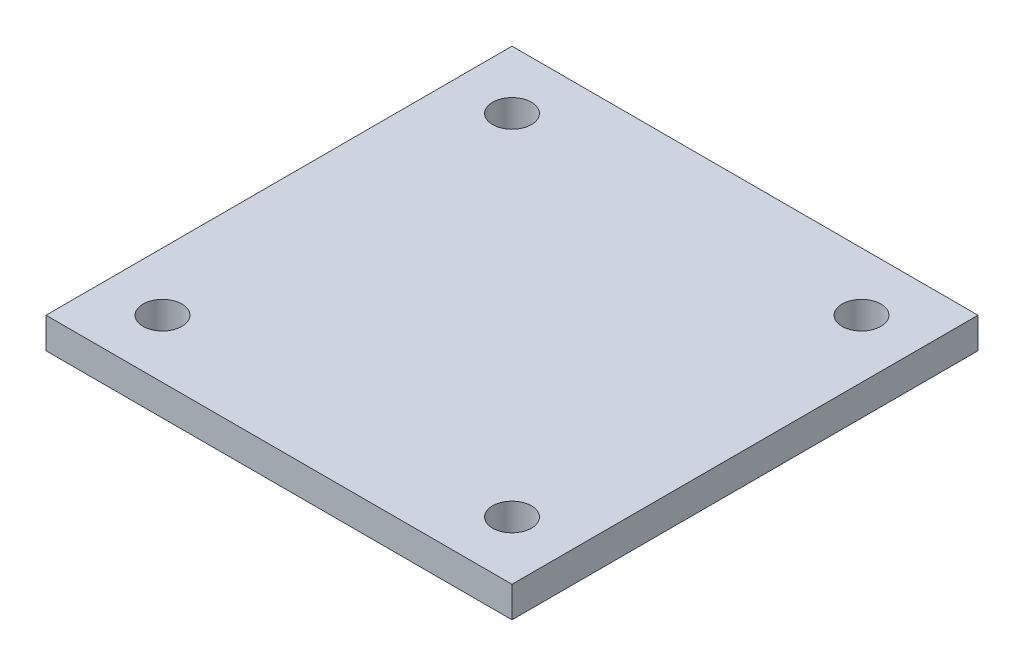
ISO-10303-21;
HEADER;
FILE_DESCRIPTION(('STEP AP214'),'2;1');
FILE_NAME('part.step','',(''),(''),'','','');
FILE_SCHEMA(('AUTOMOTIVE_DESIGN { 1 0 10303 214 1 1 1 1 }'));
ENDSEC;
DATA;
#1=APPLICATION_CONTEXT('core data for automotive mechanical design processes');
#2=APPLICATION_PROTOCOL_DEFINITION('international standard','automotive_design',2000,#1);
#3=PRODUCT_CONTEXT('',#1,'mechanical');
#4=PRODUCT('Part','Part','',(#3));
#5=PRODUCT_RELATED_PRODUCT_CATEGORY('part','',(#4));
#6=PRODUCT_DEFINITION_FORMATION('','',#4);
#7=PRODUCT_DEFINITION_CONTEXT('part definition',#1,'design');
#8=PRODUCT_DEFINITION('design','',#6,#7);
#9=PRODUCT_DEFINITION_SHAPE('','',#8);
#10=(LENGTH_UNIT() NAMED_UNIT(*) SI_UNIT(.MILLI.,.METRE.));
#11=(NAMED_UNIT(*) PLANE_ANGLE_UNIT() SI_UNIT($,.RADIAN.));
#12=(NAMED_UNIT(*) SI_UNIT($,.STERADIAN.) SOLID_ANGLE_UNIT());
#13=UNCERTAINTY_MEASURE_WITH_UNIT(LENGTH_MEASURE(1.E-05),#10,'distance_accuracy_value','');
#14=(GEOMETRIC_REPRESENTATION_CONTEXT(3) GLOBAL_UNCERTAINTY_ASSIGNED_CONTEXT((#13)) GLOBAL_UNIT_ASSIGNED_CONTEXT((#10,
#11,#12)) REPRESENTATION_CONTEXT('',''));
#15=CARTESIAN_POINT('',(0.,0.,0.));
#16=DIRECTION('',(0.,0.,1.));
#17=DIRECTION('',(1.,0.,0.));
#18=AXIS2_PLACEMENT_3D('',#15,#16,#17);
#19=CARTESIAN_POINT('',(0.,1.5875,0.));
#20=DIRECTION('',(0.,-1.,0.));
#21=DIRECTION('',(0.,0.,-1.));
#22=AXIS2_PLACEMENT_3D('',#19,#20,#21);
#23=PLANE('',#22);
#24=CARTESIAN_POINT('',(-8.99999999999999,1.5875,9.));
#25=DIRECTION('',(0.,1.,0.));
#26=DIRECTION('',(0.,0.,1.));
#27=AXIS2_PLACEMENT_3D('',#24,#25,#26);
#28=CIRCLE('',#27,1.);
#29=CARTESIAN_POINT('',(-8.99999999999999,1.5875,10.));
#30=VERTEX_POINT('',#29);
#31=EDGE_CURVE('E121',#30,#30,#28,.T.);
#32=ORIENTED_EDGE('',*,*,#31,.F.);
#33=EDGE_LOOP('',(#32));
#34=FACE_BOUND('',#33,.T.);
#35=CARTESIAN_POINT('',(-8.99999999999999,1.5875,-9.));
#36=DIRECTION('',(0.,1.,0.));
#37=DIRECTION('',(0.,0.,1.));
#38=AXIS2_PLACEMENT_3D('',#35,#36,#37);
#39=CIRCLE('',#38,1.);
#40=CARTESIAN_POINT('',(-8.99999999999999,1.5875,-8.));
#41=VERTEX_POINT('',#40);
#42=EDGE_CURVE('E100',#41,#41,#39,.T.);
#43=ORIENTED_EDGE('',*,*,#42,.F.);
#44=EDGE_LOOP('',(#43));
#45=FACE_BOUND('',#44,.T.);
#46=DIRECTION('',(0.,0.,-1.));
#47=VECTOR('',#46,1.);
#48=CARTESIAN_POINT('',(12.,1.5875,12.));
#49=LINE('',#48,#47);
#50=CARTESIAN_POINT('',(12.,1.5875,12.));
#51=VERTEX_POINT('',#50);
#52=CARTESIAN_POINT('',(12.,1.5875,-12.));
#53=VERTEX_POINT('',#52);
#54=EDGE_CURVE('E85',#51,#53,#49,.T.);
#55=ORIENTED_EDGE('',*,*,#54,.T.);
#56=DIRECTION('',(-1.,0.,0.));
#57=VECTOR('',#56,1.);
#58=CARTESIAN_POINT('',(-12.,1.5875,-12.));
#59=LINE('',#58,#57);
#60=CARTESIAN_POINT('',(-12.,1.5875,-12.));
#61=VERTEX_POINT('',#60);
#62=EDGE_CURVE('E80',#53,#61,#59,.T.);
#63=ORIENTED_EDGE('',*,*,#62,.T.);
#64=DIRECTION('',(0.,0.,1.));
#65=VECTOR('',#64,1.);
#66=CARTESIAN_POINT('',(-12.,1.5875,12.));
#67=LINE('',#66,#65);
#68=CARTESIAN_POINT('',(-12.,1.5875,12.));
#69=VERTEX_POINT('',#68);
#70=EDGE_CURVE('E83',#61,#69,#67,.T.);
#71=ORIENTED_EDGE('',*,*,#70,.T.);
#72=DIRECTION('',(1.,0.,0.));
#73=VECTOR('',#72,1.);
#74=CARTESIAN_POINT('',(-12.,1.5875,12.));
#75=LINE('',#74,#73);
#76=EDGE_CURVE('E50',#69,#51,#75,.T.);
#77=ORIENTED_EDGE('',*,*,#76,.T.);
#78=EDGE_LOOP('',(#55,#63,#71,#77));
#79=FACE_BOUND('',#78,.T.);
#80=CARTESIAN_POINT('',(9.00000000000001,1.5875,-9.));
#81=DIRECTION('',(0.,1.,0.));
#82=DIRECTION('',(0.,0.,1.));
#83=AXIS2_PLACEMENT_3D('',#80,#81,#82);
#84=CIRCLE('',#83,1.);
#85=CARTESIAN_POINT('',(9.00000000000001,1.5875,-8.));
#86=VERTEX_POINT('',#85);
#87=EDGE_CURVE('E115',#86,#86,#84,.T.);
#88=ORIENTED_EDGE('',*,*,#87,.F.);
#89=EDGE_LOOP('',(#88));
#90=FACE_BOUND('',#89,.T.);
#91=CARTESIAN_POINT('',(9.00000000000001,1.5875,9.));
#92=DIRECTION('',(0.,1.,0.));
#93=DIRECTION('',(0.,0.,1.));
#94=AXIS2_PLACEMENT_3D('',#91,#92,#93);
#95=CIRCLE('',#94,1.);
#96=CARTESIAN_POINT('',(9.00000000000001,1.5875,10.));
#97=VERTEX_POINT('',#96);
#98=EDGE_CURVE('E127',#97,#97,#95,.T.);
#99=ORIENTED_EDGE('',*,*,#98,.F.);
#100=EDGE_LOOP('',(#99));
#101=FACE_BOUND('',#100,.T.);
#102=ADVANCED_FACE('F33',(#34,#45,#79,#90,#101),#23,.F.);
#103=CARTESIAN_POINT('',(0.,0.,0.));
#104=DIRECTION('',(0.,-1.,0.));
#105=DIRECTION('',(0.,0.,-1.));
#106=AXIS2_PLACEMENT_3D('',#103,#104,#105);
#107=PLANE('',#106);
#108=CARTESIAN_POINT('',(-8.99999999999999,0.,9.));
#109=DIRECTION('',(0.,1.,0.));
#110=DIRECTION('',(0.,0.,1.));
#111=AXIS2_PLACEMENT_3D('',#108,#109,#110);
#112=CIRCLE('',#111,1.);
#113=CARTESIAN_POINT('',(-8.99999999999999,0.,10.));
#114=VERTEX_POINT('',#113);
#115=EDGE_CURVE('E124',#114,#114,#112,.T.);
#116=ORIENTED_EDGE('',*,*,#115,.T.);
#117=EDGE_LOOP('',(#116));
#118=FACE_BOUND('',#117,.T.);
#119=CARTESIAN_POINT('',(-8.99999999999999,0.,-9.));
#120=DIRECTION('',(0.,1.,0.));
#121=DIRECTION('',(0.,0.,1.));
#122=AXIS2_PLACEMENT_3D('',#119,#120,#121);
#123=CIRCLE('',#122,1.);
#124=CARTESIAN_POINT('',(-8.99999999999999,0.,-8.));
#125=VERTEX_POINT('',#124);
#126=EDGE_CURVE('E112',#125,#125,#123,.T.);
#127=ORIENTED_EDGE('',*,*,#126,.T.);
#128=EDGE_LOOP('',(#127));
#129=FACE_BOUND('',#128,.T.);
#130=DIRECTION('',(0.,0.,-1.));
#131=VECTOR('',#130,1.);
#132=CARTESIAN_POINT('',(12.,0.,12.));
#133=LINE('',#132,#131);
#134=CARTESIAN_POINT('',(12.,0.,12.));
#135=VERTEX_POINT('',#134);
#136=CARTESIAN_POINT('',(12.,0.,-12.));
#137=VERTEX_POINT('',#136);
#138=EDGE_CURVE('E97',#135,#137,#133,.T.);
#139=ORIENTED_EDGE('',*,*,#138,.F.);
#140=DIRECTION('',(1.,0.,0.));
#141=VECTOR('',#140,1.);
#142=CARTESIAN_POINT('',(-12.,0.,12.));
#143=LINE('',#142,#141);
#144=CARTESIAN_POINT('',(-12.,0.,12.));
#145=VERTEX_POINT('',#144);
#146=EDGE_CURVE('E73',#145,#135,#143,.T.);
#147=ORIENTED_EDGE('',*,*,#146,.F.);
#148=DIRECTION('',(0.,0.,1.));
#149=VECTOR('',#148,1.);
#150=CARTESIAN_POINT('',(-12.,0.,12.));
#151=LINE('',#150,#149);
#152=CARTESIAN_POINT('',(-12.,0.,-12.));
#153=VERTEX_POINT('',#152);
#154=EDGE_CURVE('E67',#153,#145,#151,.T.);
#155=ORIENTED_EDGE('',*,*,#154,.F.);
#156=DIRECTION('',(-1.,0.,0.));
#157=VECTOR('',#156,1.);
#158=CARTESIAN_POINT('',(-12.,0.,-12.));
#159=LINE('',#158,#157);
#160=EDGE_CURVE('E89',#137,#153,#159,.T.);
#161=ORIENTED_EDGE('',*,*,#160,.F.);
#162=EDGE_LOOP('',(#139,#147,#155,#161));
#163=FACE_BOUND('',#162,.T.);
#164=CARTESIAN_POINT('',(9.00000000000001,0.,-9.));
#165=DIRECTION('',(0.,1.,0.));
#166=DIRECTION('',(0.,0.,1.));
#167=AXIS2_PLACEMENT_3D('',#164,#165,#166);
#168=CIRCLE('',#167,1.);
#169=CARTESIAN_POINT('',(9.00000000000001,0.,-8.));
#170=VERTEX_POINT('',#169);
#171=EDGE_CURVE('E118',#170,#170,#168,.T.);
#172=ORIENTED_EDGE('',*,*,#171,.T.);
#173=EDGE_LOOP('',(#172));
#174=FACE_BOUND('',#173,.T.);
#175=CARTESIAN_POINT('',(9.00000000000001,0.,9.));
#176=DIRECTION('',(0.,1.,0.));
#177=DIRECTION('',(0.,0.,1.));
#178=AXIS2_PLACEMENT_3D('',#175,#176,#177);
#179=CIRCLE('',#178,1.);
#180=CARTESIAN_POINT('',(9.00000000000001,0.,10.));
#181=VERTEX_POINT('',#180);
#182=EDGE_CURVE('E130',#181,#181,#179,.T.);
#183=ORIENTED_EDGE('',*,*,#182,.T.);
#184=EDGE_LOOP('',(#183));
#185=FACE_BOUND('',#184,.T.);
#186=ADVANCED_FACE('F108',(#118,#129,#163,#174,#185),#107,.T.);
#187=CARTESIAN_POINT('',(12.,1.5875,12.));
#188=DIRECTION('',(-1.,0.,0.));
#189=DIRECTION('',(0.,0.,1.));
#190=AXIS2_PLACEMENT_3D('',#187,#188,#189);
#191=PLANE('',#190);
#192=ORIENTED_EDGE('',*,*,#138,.T.);
#193=DIRECTION('',(0.,-1.,0.));
#194=VECTOR('',#193,1.);
#195=CARTESIAN_POINT('',(12.,1.5875,-12.));
#196=LINE('',#195,#194);
#197=EDGE_CURVE('E11',#53,#137,#196,.T.);
#198=ORIENTED_EDGE('',*,*,#197,.F.);
#199=ORIENTED_EDGE('',*,*,#54,.F.);
#200=DIRECTION('',(0.,-1.,0.));
#201=VECTOR('',#200,1.);
#202=CARTESIAN_POINT('',(12.,1.5875,12.));
#203=LINE('',#202,#201);
#204=EDGE_CURVE('E93',#51,#135,#203,.T.);
#205=ORIENTED_EDGE('',*,*,#204,.T.);
#206=EDGE_LOOP('',(#192,#198,#199,#205));
#207=FACE_BOUND('',#206,.T.);
#208=ADVANCED_FACE('F35',(#207),#191,.F.);
#209=CARTESIAN_POINT('',(-12.,1.5875,-12.));
#210=DIRECTION('',(0.,0.,1.));
#211=DIRECTION('',(1.,0.,0.));
#212=AXIS2_PLACEMENT_3D('',#209,#210,#211);
#213=PLANE('',#212);
#214=ORIENTED_EDGE('',*,*,#160,.T.);
#215=DIRECTION('',(0.,-1.,0.));
#216=VECTOR('',#215,1.);
#217=CARTESIAN_POINT('',(-12.,1.5875,-12.));
#218=LINE('',#217,#216);
#219=EDGE_CURVE('E42',#61,#153,#218,.T.);
#220=ORIENTED_EDGE('',*,*,#219,.F.);
#221=ORIENTED_EDGE('',*,*,#62,.F.);
#222=ORIENTED_EDGE('',*,*,#197,.T.);
#223=EDGE_LOOP('',(#214,#220,#221,#222));
#224=FACE_BOUND('',#223,.T.);
#225=ADVANCED_FACE('F88',(#224),#213,.F.);
#226=CARTESIAN_POINT('',(-12.,1.5875,12.));
#227=DIRECTION('',(1.,0.,0.));
#228=DIRECTION('',(0.,0.,-1.));
#229=AXIS2_PLACEMENT_3D('',#226,#227,#228);
#230=PLANE('',#229);
#231=ORIENTED_EDGE('',*,*,#154,.T.);
#232=DIRECTION('',(0.,-1.,0.));
#233=VECTOR('',#232,1.);
#234=CARTESIAN_POINT('',(-12.,1.5875,12.));
#235=LINE('',#234,#233);
#236=EDGE_CURVE('E90',#69,#145,#235,.T.);
#237=ORIENTED_EDGE('',*,*,#236,.F.);
#238=ORIENTED_EDGE('',*,*,#70,.F.);
#239=ORIENTED_EDGE('',*,*,#219,.T.);
#240=EDGE_LOOP('',(#231,#237,#238,#239));
#241=FACE_BOUND('',#240,.T.);
#242=ADVANCED_FACE('F91',(#241),#230,.F.);
#243=CARTESIAN_POINT('',(-12.,1.5875,12.));
#244=DIRECTION('',(0.,0.,-1.));
#245=DIRECTION('',(-1.,0.,0.));
#246=AXIS2_PLACEMENT_3D('',#243,#244,#245);
#247=PLANE('',#246);
#248=ORIENTED_EDGE('',*,*,#146,.T.);
#249=ORIENTED_EDGE('',*,*,#204,.F.);
#250=ORIENTED_EDGE('',*,*,#76,.F.);
#251=ORIENTED_EDGE('',*,*,#236,.T.);
#252=EDGE_LOOP('',(#248,#249,#250,#251));
#253=FACE_BOUND('',#252,.T.);
#254=ADVANCED_FACE('F105',(#253),#247,.F.);
#255=CARTESIAN_POINT('',(-8.99999999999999,1.5875,-9.));
#256=DIRECTION('',(0.,-1.,0.));
#257=DIRECTION('',(0.,0.,-1.));
#258=AXIS2_PLACEMENT_3D('',#255,#256,#257);
#259=CYLINDRICAL_SURFACE('',#258,1.);
#260=ORIENTED_EDGE('',*,*,#42,.T.);
#261=EDGE_LOOP('',(#260));
#262=FACE_BOUND('',#261,.T.);
#263=ORIENTED_EDGE('',*,*,#126,.F.);
#264=EDGE_LOOP('',(#263));
#265=FACE_BOUND('',#264,.T.);
#266=ADVANCED_FACE('F150',(#262,#265),#259,.F.);
#267=CARTESIAN_POINT('',(9.00000000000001,1.5875,-9.));
#268=DIRECTION('',(0.,-1.,0.));
#269=DIRECTION('',(0.,0.,-1.));
#270=AXIS2_PLACEMENT_3D('',#267,#268,#269);
#271=CYLINDRICAL_SURFACE('',#270,1.);
#272=ORIENTED_EDGE('',*,*,#87,.T.);
#273=EDGE_LOOP('',(#272));
#274=FACE_BOUND('',#273,.T.);
#275=ORIENTED_EDGE('',*,*,#171,.F.);
#276=EDGE_LOOP('',(#275));
#277=FACE_BOUND('',#276,.T.);
#278=ADVANCED_FACE('F196',(#274,#277),#271,.F.);
#279=CARTESIAN_POINT('',(-8.99999999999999,1.5875,9.));
#280=DIRECTION('',(0.,-1.,0.));
#281=DIRECTION('',(0.,0.,-1.));
#282=AXIS2_PLACEMENT_3D('',#279,#280,#281);
#283=CYLINDRICAL_SURFACE('',#282,1.);
#284=ORIENTED_EDGE('',*,*,#31,.T.);
#285=EDGE_LOOP('',(#284));
#286=FACE_BOUND('',#285,.T.);
#287=ORIENTED_EDGE('',*,*,#115,.F.);
#288=EDGE_LOOP('',(#287));
#289=FACE_BOUND('',#288,.T.);
#290=ADVANCED_FACE('F204',(#286,#289),#283,.F.);
#291=CARTESIAN_POINT('',(9.00000000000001,1.5875,9.));
#292=DIRECTION('',(0.,-1.,0.));
#293=DIRECTION('',(0.,0.,-1.));
#294=AXIS2_PLACEMENT_3D('',#291,#292,#293);
#295=CYLINDRICAL_SURFACE('',#294,1.);
#296=ORIENTED_EDGE('',*,*,#98,.T.);
#297=EDGE_LOOP('',(#296));
#298=FACE_BOUND('',#297,.T.);
#299=ORIENTED_EDGE('',*,*,#182,.F.);
#300=EDGE_LOOP('',(#299));
#301=FACE_BOUND('',#300,.T.);
#302=ADVANCED_FACE('F136',(#298,#301),#295,.F.);
#303=CLOSED_SHELL('',(#102,#186,#208,#225,#242,#254,#266,#278,#290,#302));
#304=MANIFOLD_SOLID_BREP('B2',#303);
#305=ADVANCED_BREP_SHAPE_REPRESENTATION('',(#18,#304),#14);
#306=SHAPE_DEFINITION_REPRESENTATION(#9,#305);
ENDSEC;
END-ISO-10303-21;
